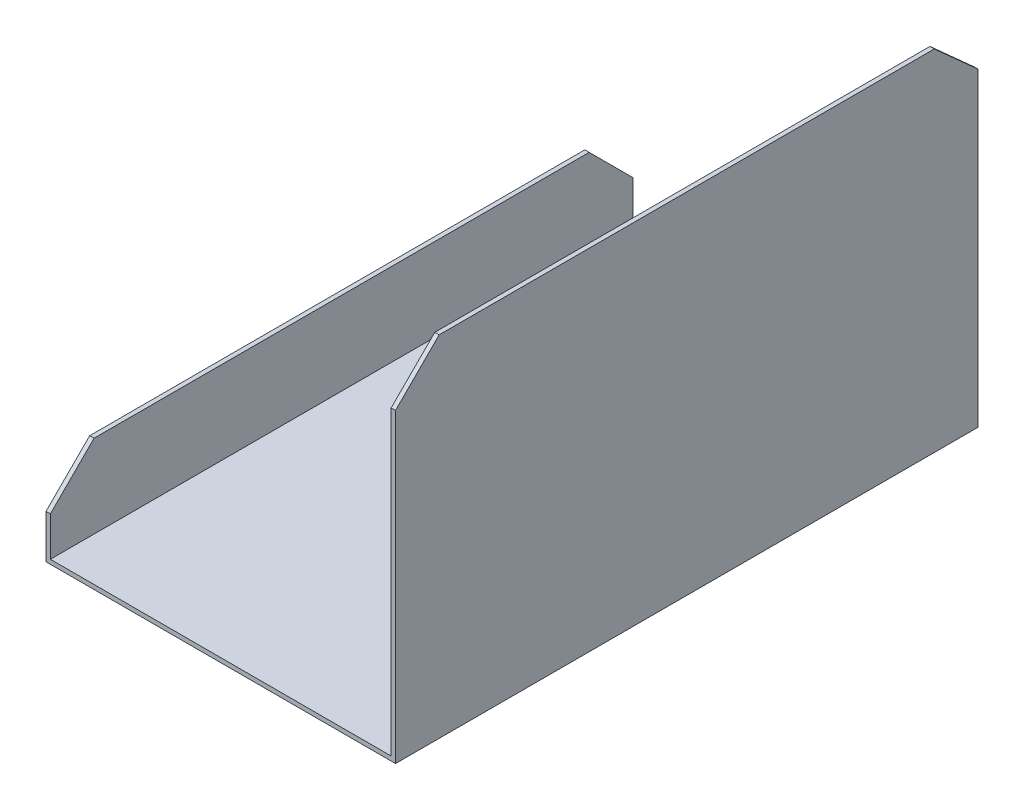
from build123d import *

# Parameters (mm, degrees)
EXTRUSION1_DEPTH             = 200
ENL_V_MAT_EXTRU_8_DEPTH      = 262.614697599
ENL_V_MAT_EXTRU_8_DEPTH_BACK = 262.614697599
ENL_V_MAT_EXTRU_9_DEPTH      = 262.614697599
ENL_V_MAT_EXTRU_9_DEPTH_BACK = 262.614697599
CHANFREIN1_SIZE              = 15


with BuildPart() as part:
    # Esquisse1 → Extrusion1 (new body)
    with BuildSketch(Plane.XY):
        Polygon((0, 28.5), (0, 0), (117, 0), (117, 118.5), (118.5, 118.5), (118.5, -1.5), (-1.5, -1.5), (-1.5, 28.5), align=None)
    extrude(amount=EXTRUSION1_DEPTH)

    # Esquisse9 → Enl_v. mat.-Extru.8 (cut, two sides: drawn at the far end of the back side and taken through both)
    with BuildSketch(Plane(origin=(118.5, 0, 0), x_dir=(0, 0, -1), z_dir=(1, 0, 0)).offset(-ENL_V_MAT_EXTRU_8_DEPTH_BACK)):
        Polygon((-526.523724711, -223.023724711), (-200, 103.5), (-185, 118.5), (141.523724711, 445.023724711), (-511.523724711, 1098.071174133), (-1179.571174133, 430.023724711), align=None)
    extrude(amount=ENL_V_MAT_EXTRU_8_DEPTH + ENL_V_MAT_EXTRU_8_DEPTH_BACK, mode=Mode.SUBTRACT)

    # Esquisse12 → Enl_v. mat.-Extru.9 (cut, two sides: drawn at the far end of the back side and taken through both)
    with BuildSketch(Plane(origin=(118.5, 0, 0), x_dir=(0, 0, -1), z_dir=(1, 0, 0)).offset(-ENL_V_MAT_EXTRU_9_DEPTH_BACK)):
        Polygon((-359.27643021, 428.348787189), (-15, 118.5), (0, 105), (344.27643021, -204.848787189), (963.974004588, 483.704073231), (260.421144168, 1116.901647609), align=None)
    extrude(amount=ENL_V_MAT_EXTRU_9_DEPTH + ENL_V_MAT_EXTRU_9_DEPTH_BACK, mode=Mode.SUBTRACT)

    # Chanfrein1
    chanfrein1_edges = [part.edges().sort_by_distance(p)[0] for p in [
        (-0.75, 28.5, 200),
        (-0.75, 28.5, 0),
    ]]
    chamfer(chanfrein1_edges, length=CHANFREIN1_SIZE)


solid = part.part
